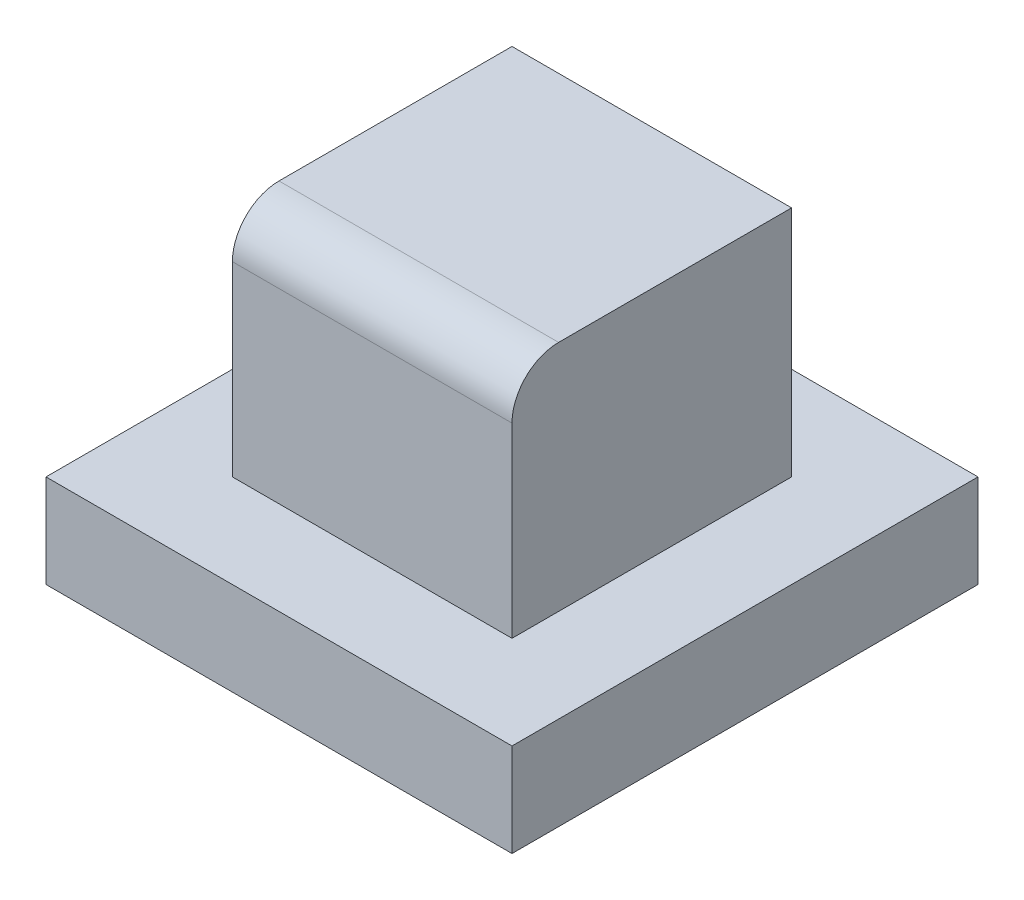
ISO-10303-21;
HEADER;
FILE_DESCRIPTION(('STEP AP214'),'2;1');
FILE_NAME('part.step','',(''),(''),'','','');
FILE_SCHEMA(('AUTOMOTIVE_DESIGN { 1 0 10303 214 1 1 1 1 }'));
ENDSEC;
DATA;
#1=APPLICATION_CONTEXT('core data for automotive mechanical design processes');
#2=APPLICATION_PROTOCOL_DEFINITION('international standard','automotive_design',2000,#1);
#3=PRODUCT_CONTEXT('',#1,'mechanical');
#4=PRODUCT('Part','Part','',(#3));
#5=PRODUCT_RELATED_PRODUCT_CATEGORY('part','',(#4));
#6=PRODUCT_DEFINITION_FORMATION('','',#4);
#7=PRODUCT_DEFINITION_CONTEXT('part definition',#1,'design');
#8=PRODUCT_DEFINITION('design','',#6,#7);
#9=PRODUCT_DEFINITION_SHAPE('','',#8);
#10=(LENGTH_UNIT() NAMED_UNIT(*) SI_UNIT(.MILLI.,.METRE.));
#11=(NAMED_UNIT(*) PLANE_ANGLE_UNIT() SI_UNIT($,.RADIAN.));
#12=(NAMED_UNIT(*) SI_UNIT($,.STERADIAN.) SOLID_ANGLE_UNIT());
#13=UNCERTAINTY_MEASURE_WITH_UNIT(LENGTH_MEASURE(1.E-05),#10,'distance_accuracy_value','');
#14=(GEOMETRIC_REPRESENTATION_CONTEXT(3) GLOBAL_UNCERTAINTY_ASSIGNED_CONTEXT((#13)) GLOBAL_UNIT_ASSIGNED_CONTEXT((#10,
#11,#12)) REPRESENTATION_CONTEXT('',''));
#15=CARTESIAN_POINT('',(0.,0.,0.));
#16=DIRECTION('',(0.,0.,1.));
#17=DIRECTION('',(1.,0.,0.));
#18=AXIS2_PLACEMENT_3D('',#15,#16,#17);
#19=CARTESIAN_POINT('',(-50.,20.,50.));
#20=DIRECTION('',(0.,-1.,0.));
#21=DIRECTION('',(1.,0.,0.));
#22=AXIS2_PLACEMENT_3D('',#19,#20,#21);
#23=PLANE('',#22);
#24=DIRECTION('',(-1.,0.,0.));
#25=VECTOR('',#24,1.);
#26=CARTESIAN_POINT('',(-50.,20.,-50.));
#27=LINE('',#26,#25);
#28=CARTESIAN_POINT('',(50.,20.,-50.));
#29=VERTEX_POINT('',#28);
#30=CARTESIAN_POINT('',(-50.,20.,-50.));
#31=VERTEX_POINT('',#30);
#32=EDGE_CURVE('E140',#29,#31,#27,.T.);
#33=ORIENTED_EDGE('',*,*,#32,.T.);
#34=DIRECTION('',(0.,0.,-1.));
#35=VECTOR('',#34,1.);
#36=CARTESIAN_POINT('',(-50.,20.,50.));
#37=LINE('',#36,#35);
#38=CARTESIAN_POINT('',(-50.,20.,50.));
#39=VERTEX_POINT('',#38);
#40=EDGE_CURVE('E151',#39,#31,#37,.T.);
#41=ORIENTED_EDGE('',*,*,#40,.F.);
#42=DIRECTION('',(-1.,0.,0.));
#43=VECTOR('',#42,1.);
#44=CARTESIAN_POINT('',(-50.,20.,50.));
#45=LINE('',#44,#43);
#46=CARTESIAN_POINT('',(50.,20.,50.));
#47=VERTEX_POINT('',#46);
#48=EDGE_CURVE('E149',#47,#39,#45,.T.);
#49=ORIENTED_EDGE('',*,*,#48,.F.);
#50=DIRECTION('',(0.,0.,-1.));
#51=VECTOR('',#50,1.);
#52=CARTESIAN_POINT('',(50.,20.,50.));
#53=LINE('',#52,#51);
#54=EDGE_CURVE('E154',#47,#29,#53,.T.);
#55=ORIENTED_EDGE('',*,*,#54,.T.);
#56=EDGE_LOOP('',(#33,#41,#49,#55));
#57=FACE_BOUND('',#56,.T.);
#58=DIRECTION('',(0.,0.,-1.));
#59=VECTOR('',#58,1.);
#60=CARTESIAN_POINT('',(30.,20.,30.));
#61=LINE('',#60,#59);
#62=CARTESIAN_POINT('',(30.,20.,30.));
#63=VERTEX_POINT('',#62);
#64=CARTESIAN_POINT('',(30.,20.,-30.));
#65=VERTEX_POINT('',#64);
#66=EDGE_CURVE('E102',#63,#65,#61,.T.);
#67=ORIENTED_EDGE('',*,*,#66,.F.);
#68=DIRECTION('',(1.,0.,0.));
#69=VECTOR('',#68,1.);
#70=CARTESIAN_POINT('',(30.,20.,30.));
#71=LINE('',#70,#69);
#72=CARTESIAN_POINT('',(-30.,20.,30.));
#73=VERTEX_POINT('',#72);
#74=EDGE_CURVE('E109',#73,#63,#71,.T.);
#75=ORIENTED_EDGE('',*,*,#74,.F.);
#76=DIRECTION('',(0.,0.,1.));
#77=VECTOR('',#76,1.);
#78=CARTESIAN_POINT('',(-30.,20.,30.));
#79=LINE('',#78,#77);
#80=CARTESIAN_POINT('',(-30.,20.,-30.));
#81=VERTEX_POINT('',#80);
#82=EDGE_CURVE('E117',#81,#73,#79,.T.);
#83=ORIENTED_EDGE('',*,*,#82,.F.);
#84=DIRECTION('',(-1.,0.,0.));
#85=VECTOR('',#84,1.);
#86=CARTESIAN_POINT('',(30.,20.,-30.));
#87=LINE('',#86,#85);
#88=EDGE_CURVE('E112',#65,#81,#87,.T.);
#89=ORIENTED_EDGE('',*,*,#88,.F.);
#90=EDGE_LOOP('',(#67,#75,#83,#89));
#91=FACE_BOUND('',#90,.T.);
#92=ADVANCED_FACE('F31',(#57,#91),#23,.F.);
#93=CARTESIAN_POINT('',(-50.,20.,50.));
#94=DIRECTION('',(1.,0.,0.));
#95=DIRECTION('',(0.,1.,0.));
#96=AXIS2_PLACEMENT_3D('',#93,#94,#95);
#97=PLANE('',#96);
#98=DIRECTION('',(0.,-1.,0.));
#99=VECTOR('',#98,1.);
#100=CARTESIAN_POINT('',(-50.,20.,-50.));
#101=LINE('',#100,#99);
#102=CARTESIAN_POINT('',(-50.,0.,-50.));
#103=VERTEX_POINT('',#102);
#104=EDGE_CURVE('E133',#31,#103,#101,.T.);
#105=ORIENTED_EDGE('',*,*,#104,.T.);
#106=DIRECTION('',(0.,0.,-1.));
#107=VECTOR('',#106,1.);
#108=CARTESIAN_POINT('',(-50.,0.,50.));
#109=LINE('',#108,#107);
#110=CARTESIAN_POINT('',(-50.,0.,50.));
#111=VERTEX_POINT('',#110);
#112=EDGE_CURVE('E160',#111,#103,#109,.T.);
#113=ORIENTED_EDGE('',*,*,#112,.F.);
#114=DIRECTION('',(0.,-1.,0.));
#115=VECTOR('',#114,1.);
#116=CARTESIAN_POINT('',(-50.,20.,50.));
#117=LINE('',#116,#115);
#118=EDGE_CURVE('E142',#39,#111,#117,.T.);
#119=ORIENTED_EDGE('',*,*,#118,.F.);
#120=ORIENTED_EDGE('',*,*,#40,.T.);
#121=EDGE_LOOP('',(#105,#113,#119,#120));
#122=FACE_BOUND('',#121,.T.);
#123=ADVANCED_FACE('F33',(#122),#97,.F.);
#124=CARTESIAN_POINT('',(-50.,0.,50.));
#125=DIRECTION('',(0.,1.,0.));
#126=DIRECTION('',(0.,0.,1.));
#127=AXIS2_PLACEMENT_3D('',#124,#125,#126);
#128=PLANE('',#127);
#129=DIRECTION('',(1.,0.,0.));
#130=VECTOR('',#129,1.);
#131=CARTESIAN_POINT('',(-50.,0.,-50.));
#132=LINE('',#131,#130);
#133=CARTESIAN_POINT('',(50.,0.,-50.));
#134=VERTEX_POINT('',#133);
#135=EDGE_CURVE('E136',#103,#134,#132,.T.);
#136=ORIENTED_EDGE('',*,*,#135,.T.);
#137=DIRECTION('',(0.,0.,-1.));
#138=VECTOR('',#137,1.);
#139=CARTESIAN_POINT('',(50.,0.,50.));
#140=LINE('',#139,#138);
#141=CARTESIAN_POINT('',(50.,0.,50.));
#142=VERTEX_POINT('',#141);
#143=EDGE_CURVE('E157',#142,#134,#140,.T.);
#144=ORIENTED_EDGE('',*,*,#143,.F.);
#145=DIRECTION('',(1.,0.,0.));
#146=VECTOR('',#145,1.);
#147=CARTESIAN_POINT('',(-50.,0.,50.));
#148=LINE('',#147,#146);
#149=EDGE_CURVE('E145',#111,#142,#148,.T.);
#150=ORIENTED_EDGE('',*,*,#149,.F.);
#151=ORIENTED_EDGE('',*,*,#112,.T.);
#152=EDGE_LOOP('',(#136,#144,#150,#151));
#153=FACE_BOUND('',#152,.T.);
#154=ADVANCED_FACE('F191',(#153),#128,.F.);
#155=CARTESIAN_POINT('',(50.,20.,50.));
#156=DIRECTION('',(-1.,0.,0.));
#157=DIRECTION('',(0.,0.,1.));
#158=AXIS2_PLACEMENT_3D('',#155,#156,#157);
#159=PLANE('',#158);
#160=DIRECTION('',(0.,1.,0.));
#161=VECTOR('',#160,1.);
#162=CARTESIAN_POINT('',(50.,20.,-50.));
#163=LINE('',#162,#161);
#164=EDGE_CURVE('E138',#134,#29,#163,.T.);
#165=ORIENTED_EDGE('',*,*,#164,.T.);
#166=ORIENTED_EDGE('',*,*,#54,.F.);
#167=DIRECTION('',(0.,1.,0.));
#168=VECTOR('',#167,1.);
#169=CARTESIAN_POINT('',(50.,20.,50.));
#170=LINE('',#169,#168);
#171=EDGE_CURVE('E147',#142,#47,#170,.T.);
#172=ORIENTED_EDGE('',*,*,#171,.F.);
#173=ORIENTED_EDGE('',*,*,#143,.T.);
#174=EDGE_LOOP('',(#165,#166,#172,#173));
#175=FACE_BOUND('',#174,.T.);
#176=ADVANCED_FACE('F197',(#175),#159,.F.);
#177=CARTESIAN_POINT('',(-50.,20.,50.));
#178=DIRECTION('',(0.,0.,1.));
#179=DIRECTION('',(1.,0.,0.));
#180=AXIS2_PLACEMENT_3D('',#177,#178,#179);
#181=PLANE('',#180);
#182=ORIENTED_EDGE('',*,*,#118,.T.);
#183=ORIENTED_EDGE('',*,*,#149,.T.);
#184=ORIENTED_EDGE('',*,*,#171,.T.);
#185=ORIENTED_EDGE('',*,*,#48,.T.);
#186=EDGE_LOOP('',(#182,#183,#184,#185));
#187=FACE_BOUND('',#186,.T.);
#188=ADVANCED_FACE('F195',(#187),#181,.T.);
#189=CARTESIAN_POINT('',(-50.,20.,-50.));
#190=DIRECTION('',(0.,0.,1.));
#191=DIRECTION('',(1.,0.,0.));
#192=AXIS2_PLACEMENT_3D('',#189,#190,#191);
#193=PLANE('',#192);
#194=ORIENTED_EDGE('',*,*,#104,.F.);
#195=ORIENTED_EDGE('',*,*,#32,.F.);
#196=ORIENTED_EDGE('',*,*,#164,.F.);
#197=ORIENTED_EDGE('',*,*,#135,.F.);
#198=EDGE_LOOP('',(#194,#195,#196,#197));
#199=FACE_BOUND('',#198,.T.);
#200=ADVANCED_FACE('F212',(#199),#193,.F.);
#201=CARTESIAN_POINT('',(30.,70.,30.));
#202=DIRECTION('',(-1.,0.,0.));
#203=DIRECTION('',(0.,-1.,0.));
#204=AXIS2_PLACEMENT_3D('',#201,#202,#203);
#205=PLANE('',#204);
#206=DIRECTION('',(0.,0.,-1.));
#207=VECTOR('',#206,1.);
#208=CARTESIAN_POINT('',(30.,70.,30.));
#209=LINE('',#208,#207);
#210=CARTESIAN_POINT('',(30.,70.,20.));
#211=VERTEX_POINT('',#210);
#212=CARTESIAN_POINT('',(30.,70.,-30.));
#213=VERTEX_POINT('',#212);
#214=EDGE_CURVE('E116',#211,#213,#209,.T.);
#215=ORIENTED_EDGE('',*,*,#214,.F.);
#216=CARTESIAN_POINT('',(30.,60.,20.));
#217=DIRECTION('',(-1.,0.,0.));
#218=DIRECTION('',(0.,-1.,0.));
#219=AXIS2_PLACEMENT_3D('',#216,#217,#218);
#220=CIRCLE('',#219,10.);
#221=CARTESIAN_POINT('',(30.,60.,30.));
#222=VERTEX_POINT('',#221);
#223=EDGE_CURVE('E53',#211,#222,#220,.F.);
#224=ORIENTED_EDGE('',*,*,#223,.T.);
#225=DIRECTION('',(0.,-1.,0.));
#226=VECTOR('',#225,1.);
#227=CARTESIAN_POINT('',(30.,70.,30.));
#228=LINE('',#227,#226);
#229=EDGE_CURVE('E98',#222,#63,#228,.T.);
#230=ORIENTED_EDGE('',*,*,#229,.T.);
#231=ORIENTED_EDGE('',*,*,#66,.T.);
#232=DIRECTION('',(0.,-1.,0.));
#233=VECTOR('',#232,1.);
#234=CARTESIAN_POINT('',(30.,70.,-30.));
#235=LINE('',#234,#233);
#236=EDGE_CURVE('E131',#213,#65,#235,.T.);
#237=ORIENTED_EDGE('',*,*,#236,.F.);
#238=EDGE_LOOP('',(#215,#224,#230,#231,#237));
#239=FACE_BOUND('',#238,.T.);
#240=ADVANCED_FACE('F100',(#239),#205,.F.);
#241=CARTESIAN_POINT('',(30.,70.,-30.));
#242=DIRECTION('',(0.,0.,1.));
#243=DIRECTION('',(1.,0.,0.));
#244=AXIS2_PLACEMENT_3D('',#241,#242,#243);
#245=PLANE('',#244);
#246=ORIENTED_EDGE('',*,*,#88,.T.);
#247=DIRECTION('',(0.,-1.,0.));
#248=VECTOR('',#247,1.);
#249=CARTESIAN_POINT('',(-30.,70.,-30.));
#250=LINE('',#249,#248);
#251=CARTESIAN_POINT('',(-30.,70.,-30.));
#252=VERTEX_POINT('',#251);
#253=EDGE_CURVE('E128',#252,#81,#250,.T.);
#254=ORIENTED_EDGE('',*,*,#253,.F.);
#255=DIRECTION('',(-1.,0.,0.));
#256=VECTOR('',#255,1.);
#257=CARTESIAN_POINT('',(30.,70.,-30.));
#258=LINE('',#257,#256);
#259=EDGE_CURVE('E119',#213,#252,#258,.T.);
#260=ORIENTED_EDGE('',*,*,#259,.F.);
#261=ORIENTED_EDGE('',*,*,#236,.T.);
#262=EDGE_LOOP('',(#246,#254,#260,#261));
#263=FACE_BOUND('',#262,.T.);
#264=ADVANCED_FACE('F174',(#263),#245,.F.);
#265=CARTESIAN_POINT('',(-30.,70.,30.));
#266=DIRECTION('',(1.,0.,0.));
#267=DIRECTION('',(0.,1.,0.));
#268=AXIS2_PLACEMENT_3D('',#265,#266,#267);
#269=PLANE('',#268);
#270=DIRECTION('',(0.,-1.,0.));
#271=VECTOR('',#270,1.);
#272=CARTESIAN_POINT('',(-30.,70.,30.));
#273=LINE('',#272,#271);
#274=CARTESIAN_POINT('',(-30.,60.,30.));
#275=VERTEX_POINT('',#274);
#276=EDGE_CURVE('E104',#275,#73,#273,.T.);
#277=ORIENTED_EDGE('',*,*,#276,.F.);
#278=CARTESIAN_POINT('',(-30.,60.,20.));
#279=DIRECTION('',(1.,0.,0.));
#280=DIRECTION('',(0.,1.,0.));
#281=AXIS2_PLACEMENT_3D('',#278,#279,#280);
#282=CIRCLE('',#281,10.);
#283=CARTESIAN_POINT('',(-30.,70.,20.));
#284=VERTEX_POINT('',#283);
#285=EDGE_CURVE('E11',#275,#284,#282,.F.);
#286=ORIENTED_EDGE('',*,*,#285,.T.);
#287=DIRECTION('',(0.,0.,1.));
#288=VECTOR('',#287,1.);
#289=CARTESIAN_POINT('',(-30.,70.,30.));
#290=LINE('',#289,#288);
#291=EDGE_CURVE('E105',#252,#284,#290,.T.);
#292=ORIENTED_EDGE('',*,*,#291,.F.);
#293=ORIENTED_EDGE('',*,*,#253,.T.);
#294=ORIENTED_EDGE('',*,*,#82,.T.);
#295=EDGE_LOOP('',(#277,#286,#292,#293,#294));
#296=FACE_BOUND('',#295,.T.);
#297=ADVANCED_FACE('F177',(#296),#269,.F.);
#298=CARTESIAN_POINT('',(30.,70.,30.));
#299=DIRECTION('',(0.,0.,-1.));
#300=DIRECTION('',(-1.,0.,0.));
#301=AXIS2_PLACEMENT_3D('',#298,#299,#300);
#302=PLANE('',#301);
#303=ORIENTED_EDGE('',*,*,#229,.F.);
#304=DIRECTION('',(1.,0.,0.));
#305=VECTOR('',#304,1.);
#306=CARTESIAN_POINT('',(-30.,60.,30.));
#307=LINE('',#306,#305);
#308=EDGE_CURVE('E39',#222,#275,#307,.F.);
#309=ORIENTED_EDGE('',*,*,#308,.T.);
#310=ORIENTED_EDGE('',*,*,#276,.T.);
#311=ORIENTED_EDGE('',*,*,#74,.T.);
#312=EDGE_LOOP('',(#303,#309,#310,#311));
#313=FACE_BOUND('',#312,.T.);
#314=ADVANCED_FACE('F115',(#313),#302,.F.);
#315=CARTESIAN_POINT('',(30.,70.,-30.));
#316=DIRECTION('',(0.,1.,0.));
#317=DIRECTION('',(-1.,0.,0.));
#318=AXIS2_PLACEMENT_3D('',#315,#316,#317);
#319=PLANE('',#318);
#320=ORIENTED_EDGE('',*,*,#291,.T.);
#321=DIRECTION('',(1.,0.,0.));
#322=VECTOR('',#321,1.);
#323=CARTESIAN_POINT('',(30.,70.,20.));
#324=LINE('',#323,#322);
#325=EDGE_CURVE('E163',#284,#211,#324,.T.);
#326=ORIENTED_EDGE('',*,*,#325,.T.);
#327=ORIENTED_EDGE('',*,*,#214,.T.);
#328=ORIENTED_EDGE('',*,*,#259,.T.);
#329=EDGE_LOOP('',(#320,#326,#327,#328));
#330=FACE_BOUND('',#329,.T.);
#331=ADVANCED_FACE('F168',(#330),#319,.T.);
#332=CARTESIAN_POINT('',(30.,60.,20.));
#333=DIRECTION('',(-1.,0.,0.));
#334=DIRECTION('',(0.,-1.,0.));
#335=AXIS2_PLACEMENT_3D('',#332,#333,#334);
#336=CYLINDRICAL_SURFACE('',#335,10.);
#337=ORIENTED_EDGE('',*,*,#285,.F.);
#338=ORIENTED_EDGE('',*,*,#308,.F.);
#339=ORIENTED_EDGE('',*,*,#223,.F.);
#340=ORIENTED_EDGE('',*,*,#325,.F.);
#341=EDGE_LOOP('',(#337,#338,#339,#340));
#342=FACE_BOUND('',#341,.T.);
#343=ADVANCED_FACE('F178',(#342),#336,.T.);
#344=CLOSED_SHELL('',(#92,#123,#154,#176,#188,#200,#240,#264,#297,#314,#331,#343));
#345=MANIFOLD_SOLID_BREP('B2',#344);
#346=ADVANCED_BREP_SHAPE_REPRESENTATION('',(#18,#345),#14);
#347=SHAPE_DEFINITION_REPRESENTATION(#9,#346);
ENDSEC;
END-ISO-10303-21;
